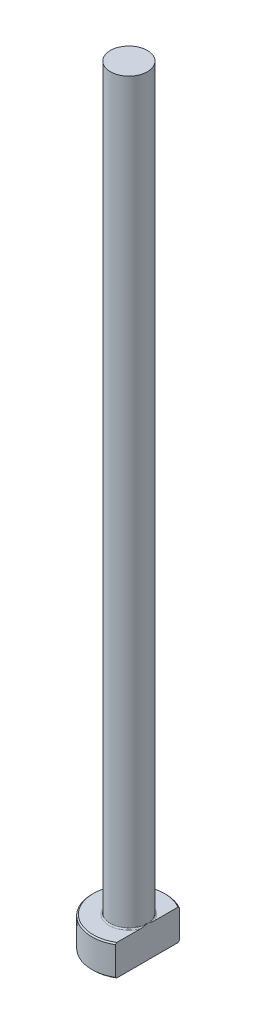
from build123d import *
from build123d.topology import SkipClean

# Parameters (mm, degrees)
CHAMFER1_SIZE = 0.2
FILLET1_R     = 0.2
KEY_DEPTH     = 126.287668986


with BuildPart() as part:
    # Sketch1 → Revolve1 (revolve)
    with BuildSketch(Plane.XY, mode=Mode.PRIVATE) as revolve1_sk:
        Polygon((0, 0), (-6, 0), (-6, 5), (-3, 5), (-3, 125), (0, 125), align=None)
    revolve(revolve1_sk.sketch.rotate(Axis((0, 259.958771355, 0), (0, -1, 0)), 270), axis=Axis((0, 259.958771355, 0), (0, -1, 0)))

    # Chamfer1
    chamfer1_edges = [part.edges().sort_by_distance(p)[0] for p in [
        (0, 5, -6),
        (0, 0, -6),
    ]]
    chamfer(chamfer1_edges, length=CHAMFER1_SIZE)

    # Fillet1
    fillet1_edges = [part.edges().sort_by_distance(p)[0] for p in [
        (0, 5, -3),
    ]]
    fillet(fillet1_edges, radius=FILLET1_R)

    # Sketch2 → KEY (cut, through all)
    with SkipClean():  # the faces are left unmerged after this step: merging them gives an invalid solid
        with BuildSketch(Plane(origin=(0, 0, 0), x_dir=(1, 0, 0), z_dir=(0, 1, 0))):
            with BuildLine():
                Line((3, 5.196152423), (3, -5.196152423))
                ThreePointArc((3, -5.196152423), (6, 0), (3, 5.196152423))
            make_face()
        extrude(amount=KEY_DEPTH, mode=Mode.SUBTRACT)


solid = part.part
